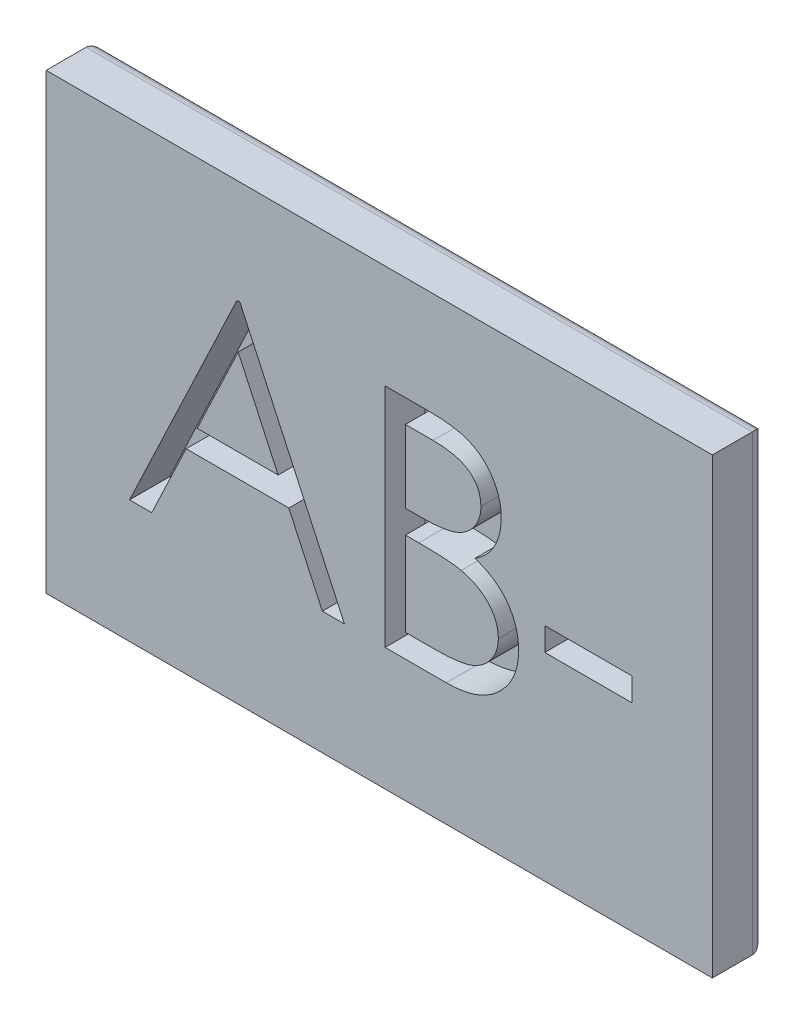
from build123d import *

# Parameters (mm, degrees)
SKETCH1_W           = 31.75
SKETCH1_H           = 21.59
BOSS_EXTRUDE1_DEPTH = 2.54
FILLET1_R           = 0.635
SKETCH2_W           = 4.151923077
SKETCH2_H           = 1.107179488
CUT_EXTRUDE1_DEPTH  = 1.905


with BuildPart() as part:
    # Sketch1 → Boss-Extrude1 (new body)
    with BuildSketch(Plane.XY):
        Rectangle(SKETCH1_W, SKETCH1_H)
    extrude(amount=BOSS_EXTRUDE1_DEPTH)

    # Fillet1
    fillet1_edges = [part.edges().sort_by_distance(p)[0] for p in [
        (0, -10.795, 0),
        (-15.875, 0, 0),
        (0, 10.795, 0),
        (15.875, 0, 0),
    ]]
    fillet(fillet1_edges, radius=FILLET1_R)

    # Sketch2 → Cut-Extrude1 (cut)
    # profile 1 of 3: a face of its own
    with BuildSketch(Plane.XY.offset(2.54)):
        with Locations((9.964615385, -0.796564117)):
            Rectangle(SKETCH2_W, SKETCH2_H)
    # profile 2 of 3: a face of its own
    with BuildSketch(Plane.XY.offset(2.54)):
        with BuildLine():
            Line((0.276794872, 5.846512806), (2.383030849, 5.846512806))
            add(Edge.make_bspline(
                [(2.383030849, 5.846512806), (2.486133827, 5.845970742), (2.685973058, 5.844920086), (2.976572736, 5.8286254), (3.248757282, 5.806407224), (3.502605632, 5.771153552), (3.738000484, 5.728615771), (3.955651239, 5.677102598), (4.154865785, 5.6153348), (4.392703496, 5.51711177), (4.663875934, 5.371153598), (4.957494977, 5.155473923), (5.20856891, 4.891667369), (5.425043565, 4.594087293), (5.597150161, 4.266734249), (5.721660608, 3.917410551), (5.800488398, 3.550621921), (5.80859524, 3.298811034), (5.812692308, 3.171549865)],
                knots=[0, 0, 0, 0, 1.001505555, 1.941167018, 2.826882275, 3.653841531, 4.429895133, 5.150066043, 5.825578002, 6.45369114, 7.647487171, 8.808567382, 9.977351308, 11.170798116, 12.373658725, 13.556498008, 14.765093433, 16, 16, 16, 16], degree=3))
            add(Edge.make_bspline(
                [(5.812692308, 3.171549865), (5.80932051, 3.05233434), (5.802694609, 2.81806459), (5.739334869, 2.475418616), (5.640142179, 2.149251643), (5.502258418, 1.840754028), (5.323055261, 1.55689607), (5.110676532, 1.295387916), (4.854443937, 1.067301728), (4.662468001, 0.939788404), (4.564952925, 0.875017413)],
                knots=[0, 0, 0, 0, 1.044552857, 2.05264487, 3.044412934, 4.028983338, 5.005914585, 5.980388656, 6.974128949, 8, 8, 8, 8], degree=3))
            add(Edge.make_bspline(
                [(4.564952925, 0.875017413), (4.687585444, 0.827935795), (4.92221183, 0.737856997), (5.245093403, 0.578598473), (5.523280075, 0.405378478), (5.758910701, 0.216213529), (5.960430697, 0.012315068), (6.136398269, -0.209306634), (6.286545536, -0.451542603), (6.41520011, -0.711867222), (6.515589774, -0.987622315), (6.590772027, -1.276221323), (6.633851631, -1.576629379), (6.639982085, -1.781072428), (6.643076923, -1.884281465)],
                knots=[0, 0, 0, 0, 1.27268992, 2.434971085, 3.483601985, 4.442670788, 5.356604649, 6.2567628, 7.179492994, 8.113709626, 9.066344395, 10.018646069, 10.999752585, 12, 12, 12, 12], degree=3))
            add(Edge.make_bspline(
                [(6.643076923, -1.884281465), (6.640064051, -1.98966186), (6.63413614, -2.197000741), (6.590401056, -2.501589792), (6.51635011, -2.792669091), (6.414349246, -3.072121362), (6.281224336, -3.339405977), (6.119213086, -3.594825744), (5.926039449, -3.835814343), (5.709945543, -4.065049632), (5.46547844, -4.271165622), (5.201723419, -4.454729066), (4.91535884, -4.605692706), (4.611087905, -4.732506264), (4.285497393, -4.829375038), (3.940049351, -4.897144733), (3.575041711, -4.942807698), (3.324567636, -4.946561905), (3.196115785, -4.948487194)],
                knots=[0, 0, 0, 0, 0.978564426, 1.925352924, 2.850884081, 3.763762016, 4.682927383, 5.618979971, 6.567305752, 7.547517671, 8.540179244, 9.531824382, 10.526200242, 11.540722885, 12.589160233, 13.674978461, 14.80764778, 16, 16, 16, 16], degree=3))
            Line((3.196115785, -4.948487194), (0.276794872, -4.948487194))
            Line((0.276794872, -4.948487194), (0.276794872, 5.846512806))
        make_face()
        with BuildLine():
            Line((1.245576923, 4.739333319), (1.245576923, 1.279397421))
            Line((1.245576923, 1.279397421), (1.896477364, 1.279397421))
            add(Edge.make_bspline(
                [(1.896477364, 1.279397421), (1.991623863, 1.280630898), (2.175466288, 1.283014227), (2.441701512, 1.289841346), (2.688829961, 1.308957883), (2.916425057, 1.328068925), (3.124128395, 1.359141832), (3.31147982, 1.396128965), (3.481419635, 1.435246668), (3.677393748, 1.501773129), (3.899687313, 1.600092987), (4.136662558, 1.752678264), (4.345575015, 1.934417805), (4.521987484, 2.144121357), (4.666367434, 2.375030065), (4.766649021, 2.623459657), (4.834649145, 2.883218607), (4.840791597, 3.061546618), (4.843910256, 3.152087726)],
                knots=[0, 0, 0, 0, 1.156816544, 2.235205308, 3.236616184, 4.169592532, 5.011045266, 5.787822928, 6.49130361, 7.128639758, 8.301311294, 9.436451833, 10.541879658, 11.654887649, 12.756523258, 13.837046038, 14.901820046, 16, 16, 16, 16], degree=3))
            add(Edge.make_bspline(
                [(4.843910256, 3.152087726), (4.842287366, 3.212002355), (4.83910389, 3.329531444), (4.81303149, 3.500861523), (4.768717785, 3.661996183), (4.711799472, 3.815143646), (4.632259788, 3.955515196), (4.538610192, 4.087964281), (4.425461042, 4.207980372), (4.296669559, 4.320154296), (4.148597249, 4.419605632), (3.98133245, 4.506708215), (3.792612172, 4.576847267), (3.585616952, 4.638274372), (3.357160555, 4.681418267), (3.109879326, 4.717360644), (2.841747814, 4.735658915), (2.656243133, 4.738081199), (2.560352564, 4.739333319)],
                knots=[0, 0, 0, 0, 0.91205012, 1.789085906, 2.630437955, 3.453916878, 4.269457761, 5.079663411, 5.91843418, 6.774407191, 7.675494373, 8.627863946, 9.638891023, 10.736472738, 11.911756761, 13.175263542, 14.539845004, 16, 16, 16, 16], degree=3))
            Line((2.560352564, 4.739333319), (1.245576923, 4.739333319))
        make_face(mode=Mode.SUBTRACT)
        with BuildLine():
            Line((1.245576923, 0.172217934), (1.245576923, -3.841307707))
            Line((1.245576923, -3.841307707), (2.625226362, -3.841307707))
            add(Edge.make_bspline(
                [(2.625226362, -3.841307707), (2.723981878, -3.84012412), (2.914320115, -3.837842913), (3.189133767, -3.830395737), (3.443843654, -3.813455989), (3.67728749, -3.786789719), (3.891986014, -3.757863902), (4.085363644, -3.718967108), (4.258987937, -3.674402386), (4.460312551, -3.605517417), (4.687018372, -3.498503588), (4.931327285, -3.337151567), (5.148541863, -3.144928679), (5.33299837, -2.922456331), (5.48416843, -2.68055171), (5.594140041, -2.424107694), (5.661966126, -2.157361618), (5.670177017, -1.975491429), (5.674294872, -1.884281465)],
                knots=[0, 0, 0, 0, 1.160039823, 2.235823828, 3.228722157, 4.157150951, 4.99529583, 5.772374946, 6.472645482, 7.099169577, 8.269452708, 9.405989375, 10.527446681, 11.663510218, 12.788923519, 13.866172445, 14.929861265, 16, 16, 16, 16], degree=3))
            add(Edge.make_bspline(
                [(5.674294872, -1.884281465), (5.673443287, -1.827242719), (5.671753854, -1.714085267), (5.646275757, -1.547793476), (5.60922155, -1.386713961), (5.561318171, -1.23040933), (5.491553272, -1.081705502), (5.410107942, -0.937661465), (5.314614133, -0.798086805), (5.165815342, -0.621627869), (4.949384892, -0.418320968), (4.641860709, -0.219268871), (4.29218815, -0.058738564), (4.038575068, 0.009422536), (3.907565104, 0.044632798)],
                knots=[0, 0, 0, 0, 0.723448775, 1.435228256, 2.130040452, 2.821711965, 3.505591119, 4.210454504, 4.921174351, 5.648778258, 7.137944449, 8.670945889, 10.280296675, 12, 12, 12, 12], degree=3))
            add(Edge.make_bspline(
                [(3.907565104, 0.044632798), (3.855042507, 0.055289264), (3.741162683, 0.078394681), (3.555465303, 0.102784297), (3.343464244, 0.124513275), (3.10466997, 0.140585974), (2.838780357, 0.157199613), (2.545227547, 0.16366064), (2.225210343, 0.171369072), (2.003165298, 0.171927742), (1.887827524, 0.172217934)],
                knots=[0, 0, 0, 0, 0.634451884, 1.375622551, 2.216452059, 3.157844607, 4.20941857, 5.370758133, 6.634282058, 8, 8, 8, 8], degree=3))
            Line((1.887827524, 0.172217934), (1.245576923, 0.172217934))
        make_face(mode=Mode.SUBTRACT)
    # profile 3 of 3: a face of its own
    with BuildSketch(Plane.XY.offset(2.54)):
        Polygon((-6.643076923, 5.846512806), (-1.660769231, -4.948487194), (-2.71388722, -4.948487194), (-4.309782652, -1.488551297), (-9.203429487, -1.488551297), (-10.844736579, -4.948487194), (-11.902179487, -4.948487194), (-6.781474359, 5.846512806), align=None)
        Polygon((-6.723087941, 3.742439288), (-8.677951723, -0.381371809), (-4.820123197, -0.381371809), align=None, mode=Mode.SUBTRACT)
    extrude(amount=-CUT_EXTRUDE1_DEPTH, mode=Mode.SUBTRACT)


solid = part.part
